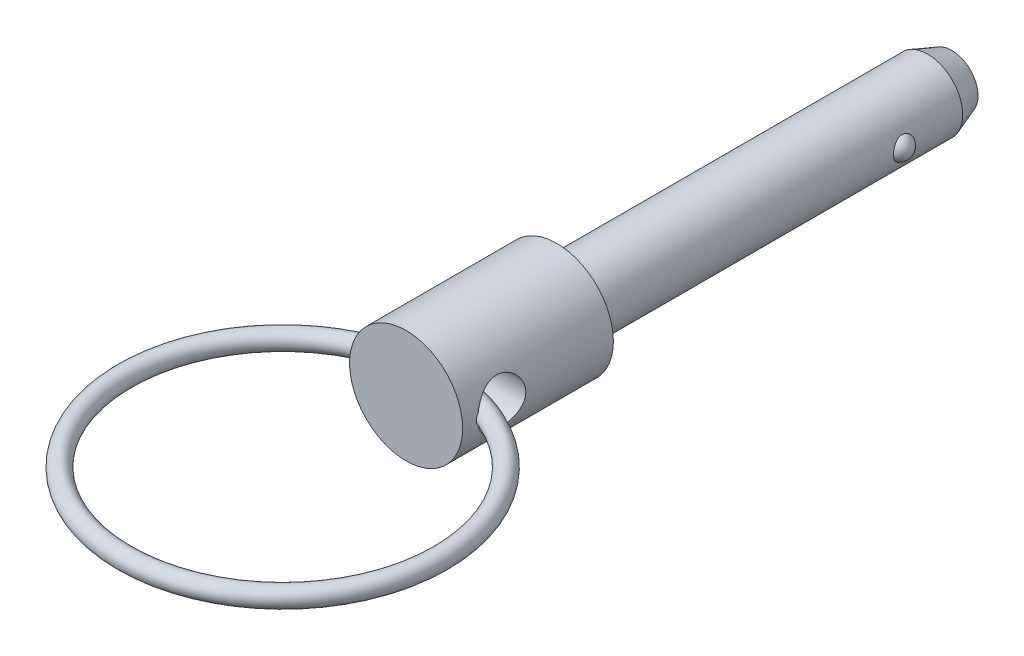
ISO-10303-21;
HEADER;
FILE_DESCRIPTION(('STEP AP214'),'2;1');
FILE_NAME('part.step','',(''),(''),'','','');
FILE_SCHEMA(('AUTOMOTIVE_DESIGN { 1 0 10303 214 1 1 1 1 }'));
ENDSEC;
DATA;
#1=APPLICATION_CONTEXT('core data for automotive mechanical design processes');
#2=APPLICATION_PROTOCOL_DEFINITION('international standard','automotive_design',2000,#1);
#3=PRODUCT_CONTEXT('',#1,'mechanical');
#4=PRODUCT('Part','Part','',(#3));
#5=PRODUCT_RELATED_PRODUCT_CATEGORY('part','',(#4));
#6=PRODUCT_DEFINITION_FORMATION('','',#4);
#7=PRODUCT_DEFINITION_CONTEXT('part definition',#1,'design');
#8=PRODUCT_DEFINITION('design','',#6,#7);
#9=PRODUCT_DEFINITION_SHAPE('','',#8);
#10=(LENGTH_UNIT() NAMED_UNIT(*) SI_UNIT(.MILLI.,.METRE.));
#11=(NAMED_UNIT(*) PLANE_ANGLE_UNIT() SI_UNIT($,.RADIAN.));
#12=(NAMED_UNIT(*) SI_UNIT($,.STERADIAN.) SOLID_ANGLE_UNIT());
#13=UNCERTAINTY_MEASURE_WITH_UNIT(LENGTH_MEASURE(1.E-05),#10,'distance_accuracy_value','');
#14=(GEOMETRIC_REPRESENTATION_CONTEXT(3) GLOBAL_UNCERTAINTY_ASSIGNED_CONTEXT((#13)) GLOBAL_UNIT_ASSIGNED_CONTEXT((#10,
#11,#12)) REPRESENTATION_CONTEXT('',''));
#15=CARTESIAN_POINT('',(0.,0.,0.));
#16=DIRECTION('',(0.,0.,1.));
#17=DIRECTION('',(1.,0.,0.));
#18=AXIS2_PLACEMENT_3D('',#15,#16,#17);
#19=CARTESIAN_POINT('',(6.35,0.,9.398));
#20=DIRECTION('',(-1.,0.,0.));
#21=DIRECTION('',(0.,0.,-1.));
#22=AXIS2_PLACEMENT_3D('',#19,#20,#21);
#23=CYLINDRICAL_SURFACE('',#22,2.0193);
#24=CARTESIAN_POINT('',(-4.76270000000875,0.498153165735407,11.3548893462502));
#25=CARTESIAN_POINT('',(-4.72833190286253,0.475048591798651,11.3607446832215));
#26=CARTESIAN_POINT('',(-4.69505034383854,0.449919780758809,11.3667299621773));
#27=CARTESIAN_POINT('',(-4.63192457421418,0.394832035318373,11.3785339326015));
#28=CARTESIAN_POINT('',(-4.60213511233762,0.36481030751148,11.3843491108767));
#29=CARTESIAN_POINT('',(-4.55535458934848,0.308281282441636,11.3937756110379));
#30=CARTESIAN_POINT('',(-4.53705372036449,0.282907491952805,11.3975656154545));
#31=CARTESIAN_POINT('',(-4.50470768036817,0.229597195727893,11.4043835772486));
#32=CARTESIAN_POINT('',(-4.49064226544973,0.201673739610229,11.4074151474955));
#33=CARTESIAN_POINT('',(-4.46975490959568,0.148629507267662,11.4119668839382));
#34=CARTESIAN_POINT('',(-4.46210314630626,0.123852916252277,11.413657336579));
#35=CARTESIAN_POINT('',(-4.45097170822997,0.0733134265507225,11.4161269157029));
#36=CARTESIAN_POINT('',(-4.4474922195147,0.0475504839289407,11.4169060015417));
#37=CARTESIAN_POINT('',(-4.44500621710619,-0.00425946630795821,11.4174619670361));
#38=CARTESIAN_POINT('',(-4.44600914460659,-0.0303069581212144,11.4172367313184));
#39=CARTESIAN_POINT('',(-4.45241947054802,-0.0818207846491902,11.4158064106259));
#40=CARTESIAN_POINT('',(-4.45782777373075,-0.10728699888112,11.414601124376));
#41=CARTESIAN_POINT('',(-4.47240849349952,-0.156294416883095,11.4113883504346));
#42=CARTESIAN_POINT('',(-4.48147591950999,-0.179868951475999,11.4094032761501));
#43=CARTESIAN_POINT('',(-4.50279050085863,-0.225454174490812,11.404805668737));
#44=CARTESIAN_POINT('',(-4.51503925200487,-0.24746407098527,11.4021928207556));
#45=CARTESIAN_POINT('',(-4.55011891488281,-0.302206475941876,11.394845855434));
#46=CARTESIAN_POINT('',(-4.57493397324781,-0.33362129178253,11.3897686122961));
#47=CARTESIAN_POINT('',(-4.62912866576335,-0.392111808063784,11.3790894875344));
#48=CARTESIAN_POINT('',(-4.65852008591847,-0.419175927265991,11.3734862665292));
#49=CARTESIAN_POINT('',(-4.71307862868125,-0.4633355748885,11.3635175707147));
#50=CARTESIAN_POINT('',(-4.73757440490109,-0.481267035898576,11.3591766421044));
#51=CARTESIAN_POINT('',(-4.76270000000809,-0.49815316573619,11.35488934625));
#52=B_SPLINE_CURVE_WITH_KNOTS('',3,(#24,#25,#26,#27,#28,#29,#30,#31,#32,#33,#34,#35,#36,#37,#38,
#39,#40,#41,#42,#43,#44,#45,#46,#47,#48,#49,#50,#51),.UNSPECIFIED.,.F.,.F.,(4,2,2,2,2,2,2,2,2,2,
2,2,2,4),(0.,0.125801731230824,0.253367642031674,0.347579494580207,0.441333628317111,
0.518959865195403,0.596589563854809,0.674382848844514,0.752192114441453,0.82791171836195,
0.903669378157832,1.02403641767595,1.14471874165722,1.23653238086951),.UNSPECIFIED.);
#53=CARTESIAN_POINT('',(-4.73813099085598,0.481166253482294,11.3591352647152));
#54=VERTEX_POINT('',#53);
#55=CARTESIAN_POINT('',(-4.73813099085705,-0.481166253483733,11.359135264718));
#56=VERTEX_POINT('',#55);
#57=EDGE_CURVE('E40',#54,#56,#52,.T.);
#58=ORIENTED_EDGE('',*,*,#57,.F.);
#59=CARTESIAN_POINT('',(-4.7625,0.,11.4173));
#60=CARTESIAN_POINT('',(-4.76249489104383,-0.108112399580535,11.4172937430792));
#61=CARTESIAN_POINT('',(-4.75878025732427,-0.216312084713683,11.4085747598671));
#62=CARTESIAN_POINT('',(-4.74429807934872,-0.429541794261,11.3740482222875));
#63=CARTESIAN_POINT('',(-4.73352107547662,-0.534567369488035,11.3482177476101));
#64=CARTESIAN_POINT('',(-4.70606638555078,-0.738151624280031,11.280597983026));
#65=CARTESIAN_POINT('',(-4.68940628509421,-0.836728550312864,11.238856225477));
#66=CARTESIAN_POINT('',(-4.65179514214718,-1.02541561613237,11.1408163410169));
#67=CARTESIAN_POINT('',(-4.63084399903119,-1.11552555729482,11.0845178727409));
#68=CARTESIAN_POINT('',(-4.58553515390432,-1.28946876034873,10.9559107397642));
#69=CARTESIAN_POINT('',(-4.56106355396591,-1.37280723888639,10.8829734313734));
#70=CARTESIAN_POINT('',(-4.51195602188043,-1.52649281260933,10.7244940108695));
#71=CARTESIAN_POINT('',(-4.48732001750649,-1.59683374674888,10.638945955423));
#72=CARTESIAN_POINT('',(-4.43925108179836,-1.7261116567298,10.4523438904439));
#73=CARTESIAN_POINT('',(-4.41594507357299,-1.78427664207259,10.3507188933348));
#74=CARTESIAN_POINT('',(-4.37499469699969,-1.88246618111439,10.1379969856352));
#75=CARTESIAN_POINT('',(-4.35734737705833,-1.92250019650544,10.0269050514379));
#76=CARTESIAN_POINT('',(-4.33095312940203,-1.98122376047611,9.80411364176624));
#77=CARTESIAN_POINT('',(-4.32180970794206,-2.0008697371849,9.69271508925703));
#78=CARTESIAN_POINT('',(-4.31232297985,-2.02124136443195,9.46785625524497));
#79=CARTESIAN_POINT('',(-4.31197457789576,-2.02197796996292,9.35439720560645));
#80=CARTESIAN_POINT('',(-4.31978298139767,-2.00522830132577,9.13832342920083));
#81=CARTESIAN_POINT('',(-4.32726229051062,-1.98919366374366,9.03556669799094));
#82=CARTESIAN_POINT('',(-4.34873498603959,-1.94179810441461,8.83436976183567));
#83=CARTESIAN_POINT('',(-4.36272967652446,-1.91043411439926,8.73593042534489));
#84=CARTESIAN_POINT('',(-4.39597564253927,-1.83265370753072,8.54363008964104));
#85=CARTESIAN_POINT('',(-4.41533413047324,-1.7859262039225,8.44991428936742));
#86=CARTESIAN_POINT('',(-4.45710273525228,-1.67896759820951,8.27128429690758));
#87=CARTESIAN_POINT('',(-4.47951396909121,-1.61873154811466,8.1863733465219));
#88=CARTESIAN_POINT('',(-4.52725353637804,-1.48026834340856,8.0199216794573));
#89=CARTESIAN_POINT('',(-4.55266534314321,-1.40092677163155,7.93932933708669));
#90=CARTESIAN_POINT('',(-4.6018976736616,-1.22958667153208,7.79224755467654));
#91=CARTESIAN_POINT('',(-4.62571737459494,-1.13758167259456,7.72576536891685));
#92=CARTESIAN_POINT('',(-4.66982369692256,-0.940529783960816,7.60732387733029));
#93=CARTESIAN_POINT('',(-4.69000583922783,-0.835212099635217,7.55577397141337));
#94=CARTESIAN_POINT('',(-4.72372878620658,-0.616416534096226,7.47153070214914));
#95=CARTESIAN_POINT('',(-4.73728278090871,-0.502955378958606,7.43879986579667));
#96=CARTESIAN_POINT('',(-4.75192155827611,-0.323662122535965,7.40374908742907));
#97=CARTESIAN_POINT('',(-4.75587275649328,-0.259363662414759,7.39437239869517));
#98=CARTESIAN_POINT('',(-4.76116348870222,-0.130053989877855,7.3818460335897));
#99=CARTESIAN_POINT('',(-4.76250307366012,-0.0650427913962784,7.3786962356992));
#100=CARTESIAN_POINT('',(-4.76249489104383,0.108112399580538,7.37870625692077));
#101=CARTESIAN_POINT('',(-4.75878025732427,0.216312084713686,7.38742524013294));
#102=CARTESIAN_POINT('',(-4.74429807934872,0.429541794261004,7.42195177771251));
#103=CARTESIAN_POINT('',(-4.73352107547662,0.53456736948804,7.44778225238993));
#104=CARTESIAN_POINT('',(-4.70606638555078,0.738151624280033,7.51540201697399));
#105=CARTESIAN_POINT('',(-4.68940628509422,0.836728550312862,7.55714377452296));
#106=CARTESIAN_POINT('',(-4.65179514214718,1.02541561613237,7.65518365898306));
#107=CARTESIAN_POINT('',(-4.63084399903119,1.11552555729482,7.71148212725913));
#108=CARTESIAN_POINT('',(-4.58553515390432,1.28946876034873,7.84008926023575));
#109=CARTESIAN_POINT('',(-4.56106355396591,1.37280723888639,7.91302656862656));
#110=CARTESIAN_POINT('',(-4.51195602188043,1.52649281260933,8.0715059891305));
#111=CARTESIAN_POINT('',(-4.48732001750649,1.59683374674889,8.15705404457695));
#112=CARTESIAN_POINT('',(-4.43925108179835,1.7261116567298,8.3436561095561));
#113=CARTESIAN_POINT('',(-4.41594507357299,1.78427664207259,8.44528110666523));
#114=CARTESIAN_POINT('',(-4.37499469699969,1.88246618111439,8.65800301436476));
#115=CARTESIAN_POINT('',(-4.35734737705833,1.92250019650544,8.76909494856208));
#116=CARTESIAN_POINT('',(-4.33095312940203,1.98122376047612,8.99188635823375));
#117=CARTESIAN_POINT('',(-4.32180970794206,2.00086973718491,9.10328491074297));
#118=CARTESIAN_POINT('',(-4.31232297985,2.02124136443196,9.32814374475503));
#119=CARTESIAN_POINT('',(-4.31197457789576,2.02197796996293,9.44160279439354));
#120=CARTESIAN_POINT('',(-4.31978298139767,2.00522830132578,9.65767657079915));
#121=CARTESIAN_POINT('',(-4.32726229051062,1.98919366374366,9.76043330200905));
#122=CARTESIAN_POINT('',(-4.34873498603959,1.94179810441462,9.96163023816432));
#123=CARTESIAN_POINT('',(-4.36272967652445,1.91043411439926,10.0600695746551));
#124=CARTESIAN_POINT('',(-4.39597564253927,1.83265370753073,10.252369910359));
#125=CARTESIAN_POINT('',(-4.41533413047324,1.78592620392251,10.3460857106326));
#126=CARTESIAN_POINT('',(-4.45710273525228,1.67896759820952,10.5247157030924));
#127=CARTESIAN_POINT('',(-4.47951396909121,1.61873154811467,10.6096266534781));
#128=CARTESIAN_POINT('',(-4.52725353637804,1.48026834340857,10.7760783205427));
#129=CARTESIAN_POINT('',(-4.55266534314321,1.40092677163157,10.8566706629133));
#130=CARTESIAN_POINT('',(-4.60189767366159,1.22958667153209,11.0037524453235));
#131=CARTESIAN_POINT('',(-4.62571737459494,1.13758167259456,11.0702346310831));
#132=CARTESIAN_POINT('',(-4.66982369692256,0.940529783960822,11.1886761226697));
#133=CARTESIAN_POINT('',(-4.69000583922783,0.835212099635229,11.2402260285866));
#134=CARTESIAN_POINT('',(-4.72372878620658,0.616416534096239,11.3244692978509));
#135=CARTESIAN_POINT('',(-4.73728278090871,0.502955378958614,11.3572001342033));
#136=CARTESIAN_POINT('',(-4.75192155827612,0.323662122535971,11.3922509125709));
#137=CARTESIAN_POINT('',(-4.75587275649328,0.259363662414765,11.4016276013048));
#138=CARTESIAN_POINT('',(-4.76116348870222,0.130053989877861,11.4141539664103));
#139=CARTESIAN_POINT('',(-4.76250307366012,0.0650427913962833,11.4173037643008));
#140=CARTESIAN_POINT('',(-4.7625,0.,11.4173));
#141=B_SPLINE_CURVE_WITH_KNOTS('',3,(#59,#60,#61,#62,#63,#64,#65,#66,#67,#68,#69,#70,#71,#72,
#73,#74,#75,#76,#77,#78,#79,#80,#81,#82,#83,#84,#85,#86,#87,#88,#89,#90,#91,#92,#93,#94,#95,#96,
#97,#98,#99,#100,#101,#102,#103,#104,#105,#106,#107,#108,#109,#110,#111,#112,#113,#114,#115,
#116,#117,#118,#119,#120,#121,#122,#123,#124,#125,#126,#127,#128,#129,#130,#131,#132,#133,#134,
#135,#136,#137,#138,#139,#140),.UNSPECIFIED.,.T.,.F.,(4,2,2,2,2,2,2,2,2,2,2,2,2,2,2,2,2,2,2,2,2,
2,2,2,2,2,2,2,2,2,2,2,2,2,2,2,2,2,2,2,4),(0.,0.324084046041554,0.648603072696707,
0.97216015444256,1.29572482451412,1.63451297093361,1.97346129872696,2.32983137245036,
2.68601525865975,3.02460962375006,3.36300782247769,3.6743618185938,3.98577815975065,
4.30393445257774,4.6222074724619,4.96838833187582,5.31474674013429,5.66985671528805,
6.02425711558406,6.21923699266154,6.41421306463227,6.73829711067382,7.06281613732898,
7.38637321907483,7.70993788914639,8.04872603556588,8.38767436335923,8.74404443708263,
9.10022832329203,9.43882268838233,9.77722088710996,10.0885748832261,10.3999912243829,
10.71814751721,11.0364205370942,11.3826013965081,11.7289598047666,12.0840697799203,
12.4384701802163,12.6334500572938,12.8284261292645),.UNSPECIFIED.);
#142=EDGE_CURVE('E54',#56,#54,#141,.T.);
#143=ORIENTED_EDGE('',*,*,#142,.F.);
#144=EDGE_LOOP('',(#58,#143));
#145=FACE_BOUND('',#144,.T.);
#146=CARTESIAN_POINT('',(4.76270000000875,-0.498153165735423,11.3548893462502));
#147=CARTESIAN_POINT('',(4.72833190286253,-0.475048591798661,11.3607446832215));
#148=CARTESIAN_POINT('',(4.69505034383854,-0.44991978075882,11.3667299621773));
#149=CARTESIAN_POINT('',(4.63192457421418,-0.394832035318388,11.3785339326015));
#150=CARTESIAN_POINT('',(4.60213511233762,-0.364810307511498,11.3843491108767));
#151=CARTESIAN_POINT('',(4.55535458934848,-0.308281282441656,11.3937756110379));
#152=CARTESIAN_POINT('',(4.53705372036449,-0.282907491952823,11.3975656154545));
#153=CARTESIAN_POINT('',(4.50470768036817,-0.229597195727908,11.4043835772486));
#154=CARTESIAN_POINT('',(4.49064226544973,-0.201673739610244,11.4074151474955));
#155=CARTESIAN_POINT('',(4.46975490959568,-0.148629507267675,11.4119668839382));
#156=CARTESIAN_POINT('',(4.46210314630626,-0.123852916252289,11.413657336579));
#157=CARTESIAN_POINT('',(4.45097170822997,-0.0733134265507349,11.4161269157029));
#158=CARTESIAN_POINT('',(4.4474922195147,-0.0475504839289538,11.4169060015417));
#159=CARTESIAN_POINT('',(4.44500621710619,0.00425946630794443,11.4174619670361));
#160=CARTESIAN_POINT('',(4.44600914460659,0.0303069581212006,11.4172367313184));
#161=CARTESIAN_POINT('',(4.45241947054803,0.0818207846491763,11.4158064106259));
#162=CARTESIAN_POINT('',(4.45782777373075,0.107286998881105,11.414601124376));
#163=CARTESIAN_POINT('',(4.47240849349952,0.15629441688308,11.4113883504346));
#164=CARTESIAN_POINT('',(4.48147591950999,0.179868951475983,11.4094032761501));
#165=CARTESIAN_POINT('',(4.50279050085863,0.225454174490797,11.404805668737));
#166=CARTESIAN_POINT('',(4.51503925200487,0.247464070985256,11.4021928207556));
#167=CARTESIAN_POINT('',(4.55011891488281,0.302206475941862,11.394845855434));
#168=CARTESIAN_POINT('',(4.57493397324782,0.333621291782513,11.3897686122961));
#169=CARTESIAN_POINT('',(4.62912866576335,0.392111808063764,11.3790894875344));
#170=CARTESIAN_POINT('',(4.65852008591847,0.419175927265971,11.3734862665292));
#171=CARTESIAN_POINT('',(4.71307862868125,0.463335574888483,11.3635175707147));
#172=CARTESIAN_POINT('',(4.73757440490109,0.481267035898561,11.3591766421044));
#173=CARTESIAN_POINT('',(4.76270000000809,0.498153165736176,11.35488934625));
#174=B_SPLINE_CURVE_WITH_KNOTS('',3,(#146,#147,#148,#149,#150,#151,#152,#153,#154,#155,#156,
#157,#158,#159,#160,#161,#162,#163,#164,#165,#166,#167,#168,#169,#170,#171,#172,#173),
.UNSPECIFIED.,.F.,.F.,(4,2,2,2,2,2,2,2,2,2,2,2,2,4),(0.,0.125801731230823,0.253367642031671,
0.347579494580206,0.441333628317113,0.518959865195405,0.59658956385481,0.674382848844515,
0.752192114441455,0.827911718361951,0.903669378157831,1.02403641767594,1.14471874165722,
1.23653238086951),.UNSPECIFIED.);
#175=CARTESIAN_POINT('',(4.73813099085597,-0.481166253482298,11.3591352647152));
#176=VERTEX_POINT('',#175);
#177=CARTESIAN_POINT('',(4.73813099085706,0.481166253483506,11.359135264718));
#178=VERTEX_POINT('',#177);
#179=EDGE_CURVE('E33',#176,#178,#174,.T.);
#180=ORIENTED_EDGE('',*,*,#179,.F.);
#181=CARTESIAN_POINT('',(4.7625,0.,7.3787));
#182=CARTESIAN_POINT('',(4.76249489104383,-0.108112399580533,7.37870625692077));
#183=CARTESIAN_POINT('',(4.75878025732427,-0.216312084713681,7.38742524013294));
#184=CARTESIAN_POINT('',(4.74429807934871,-0.429541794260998,7.4219517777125));
#185=CARTESIAN_POINT('',(4.73352107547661,-0.534567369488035,7.44778225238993));
#186=CARTESIAN_POINT('',(4.70606638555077,-0.738151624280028,7.51540201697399));
#187=CARTESIAN_POINT('',(4.68940628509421,-0.836728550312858,7.55714377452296));
#188=CARTESIAN_POINT('',(4.65179514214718,-1.02541561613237,7.65518365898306));
#189=CARTESIAN_POINT('',(4.63084399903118,-1.11552555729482,7.71148212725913));
#190=CARTESIAN_POINT('',(4.58553515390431,-1.28946876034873,7.84008926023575));
#191=CARTESIAN_POINT('',(4.5610635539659,-1.37280723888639,7.91302656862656));
#192=CARTESIAN_POINT('',(4.51195602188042,-1.52649281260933,8.0715059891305));
#193=CARTESIAN_POINT('',(4.48732001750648,-1.59683374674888,8.15705404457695));
#194=CARTESIAN_POINT('',(4.43925108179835,-1.7261116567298,8.3436561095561));
#195=CARTESIAN_POINT('',(4.41594507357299,-1.78427664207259,8.44528110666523));
#196=CARTESIAN_POINT('',(4.37499469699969,-1.88246618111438,8.65800301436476));
#197=CARTESIAN_POINT('',(4.35734737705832,-1.92250019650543,8.76909494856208));
#198=CARTESIAN_POINT('',(4.33095312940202,-1.98122376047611,8.99188635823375));
#199=CARTESIAN_POINT('',(4.32180970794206,-2.0008697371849,9.10328491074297));
#200=CARTESIAN_POINT('',(4.31232297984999,-2.02124136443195,9.32814374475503));
#201=CARTESIAN_POINT('',(4.31197457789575,-2.02197796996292,9.44160279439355));
#202=CARTESIAN_POINT('',(4.31978298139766,-2.00522830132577,9.65767657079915));
#203=CARTESIAN_POINT('',(4.32726229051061,-1.98919366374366,9.76043330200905));
#204=CARTESIAN_POINT('',(4.34873498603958,-1.94179810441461,9.96163023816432));
#205=CARTESIAN_POINT('',(4.36272967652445,-1.91043411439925,10.0600695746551));
#206=CARTESIAN_POINT('',(4.39597564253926,-1.83265370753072,10.252369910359));
#207=CARTESIAN_POINT('',(4.41533413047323,-1.7859262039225,10.3460857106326));
#208=CARTESIAN_POINT('',(4.45710273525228,-1.67896759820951,10.5247157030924));
#209=CARTESIAN_POINT('',(4.4795139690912,-1.61873154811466,10.6096266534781));
#210=CARTESIAN_POINT('',(4.52725353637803,-1.48026834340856,10.7760783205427));
#211=CARTESIAN_POINT('',(4.55266534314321,-1.40092677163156,10.8566706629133));
#212=CARTESIAN_POINT('',(4.60189767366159,-1.22958667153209,11.0037524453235));
#213=CARTESIAN_POINT('',(4.62571737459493,-1.13758167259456,11.0702346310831));
#214=CARTESIAN_POINT('',(4.66982369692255,-0.940529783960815,11.1886761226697));
#215=CARTESIAN_POINT('',(4.69000583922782,-0.835212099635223,11.2402260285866));
#216=CARTESIAN_POINT('',(4.72372878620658,-0.616416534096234,11.3244692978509));
#217=CARTESIAN_POINT('',(4.7372827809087,-0.502955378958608,11.3572001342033));
#218=CARTESIAN_POINT('',(4.75192155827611,-0.323662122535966,11.3922509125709));
#219=CARTESIAN_POINT('',(4.75587275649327,-0.25936366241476,11.4016276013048));
#220=CARTESIAN_POINT('',(4.76116348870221,-0.130053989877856,11.4141539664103));
#221=CARTESIAN_POINT('',(4.76250307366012,-0.0650427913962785,11.4173037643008));
#222=CARTESIAN_POINT('',(4.76249489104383,0.10811239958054,11.4172937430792));
#223=CARTESIAN_POINT('',(4.75878025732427,0.216312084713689,11.4085747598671));
#224=CARTESIAN_POINT('',(4.74429807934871,0.429541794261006,11.3740482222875));
#225=CARTESIAN_POINT('',(4.73352107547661,0.534567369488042,11.3482177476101));
#226=CARTESIAN_POINT('',(4.70606638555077,0.738151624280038,11.280597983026));
#227=CARTESIAN_POINT('',(4.68940628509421,0.83672855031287,11.238856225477));
#228=CARTESIAN_POINT('',(4.65179514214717,1.02541561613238,11.1408163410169));
#229=CARTESIAN_POINT('',(4.63084399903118,1.11552555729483,11.0845178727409));
#230=CARTESIAN_POINT('',(4.58553515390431,1.28946876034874,10.9559107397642));
#231=CARTESIAN_POINT('',(4.5610635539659,1.3728072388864,10.8829734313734));
#232=CARTESIAN_POINT('',(4.51195602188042,1.52649281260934,10.7244940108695));
#233=CARTESIAN_POINT('',(4.48732001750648,1.59683374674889,10.638945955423));
#234=CARTESIAN_POINT('',(4.43925108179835,1.72611165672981,10.4523438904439));
#235=CARTESIAN_POINT('',(4.41594507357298,1.78427664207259,10.3507188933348));
#236=CARTESIAN_POINT('',(4.37499469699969,1.8824661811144,10.1379969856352));
#237=CARTESIAN_POINT('',(4.35734737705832,1.92250019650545,10.0269050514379));
#238=CARTESIAN_POINT('',(4.33095312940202,1.98122376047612,9.80411364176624));
#239=CARTESIAN_POINT('',(4.32180970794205,2.00086973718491,9.69271508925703));
#240=CARTESIAN_POINT('',(4.31232297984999,2.02124136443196,9.46785625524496));
#241=CARTESIAN_POINT('',(4.31197457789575,2.02197796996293,9.35439720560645));
#242=CARTESIAN_POINT('',(4.31978298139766,2.00522830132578,9.13832342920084));
#243=CARTESIAN_POINT('',(4.32726229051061,1.98919366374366,9.03556669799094));
#244=CARTESIAN_POINT('',(4.34873498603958,1.94179810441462,8.83436976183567));
#245=CARTESIAN_POINT('',(4.36272967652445,1.91043411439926,8.73593042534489));
#246=CARTESIAN_POINT('',(4.39597564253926,1.83265370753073,8.54363008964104));
#247=CARTESIAN_POINT('',(4.41533413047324,1.7859262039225,8.44991428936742));
#248=CARTESIAN_POINT('',(4.45710273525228,1.67896759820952,8.27128429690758));
#249=CARTESIAN_POINT('',(4.47951396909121,1.61873154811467,8.1863733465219));
#250=CARTESIAN_POINT('',(4.52725353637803,1.48026834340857,8.0199216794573));
#251=CARTESIAN_POINT('',(4.55266534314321,1.40092677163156,7.93932933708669));
#252=CARTESIAN_POINT('',(4.60189767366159,1.22958667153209,7.79224755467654));
#253=CARTESIAN_POINT('',(4.62571737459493,1.13758167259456,7.72576536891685));
#254=CARTESIAN_POINT('',(4.66982369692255,0.940529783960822,7.60732387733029));
#255=CARTESIAN_POINT('',(4.69000583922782,0.835212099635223,7.55577397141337));
#256=CARTESIAN_POINT('',(4.72372878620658,0.616416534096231,7.47153070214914));
#257=CARTESIAN_POINT('',(4.7372827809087,0.50295537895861,7.43879986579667));
#258=CARTESIAN_POINT('',(4.75192155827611,0.32366212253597,7.40374908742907));
#259=CARTESIAN_POINT('',(4.75587275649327,0.259363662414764,7.39437239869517));
#260=CARTESIAN_POINT('',(4.76116348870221,0.13005398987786,7.3818460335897));
#261=CARTESIAN_POINT('',(4.76250307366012,0.0650427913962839,7.3786962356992));
#262=CARTESIAN_POINT('',(4.7625,0.,7.3787));
#263=B_SPLINE_CURVE_WITH_KNOTS('',3,(#181,#182,#183,#184,#185,#186,#187,#188,#189,#190,#191,
#192,#193,#194,#195,#196,#197,#198,#199,#200,#201,#202,#203,#204,#205,#206,#207,#208,#209,#210,
#211,#212,#213,#214,#215,#216,#217,#218,#219,#220,#221,#222,#223,#224,#225,#226,#227,#228,#229,
#230,#231,#232,#233,#234,#235,#236,#237,#238,#239,#240,#241,#242,#243,#244,#245,#246,#247,#248,
#249,#250,#251,#252,#253,#254,#255,#256,#257,#258,#259,#260,#261,#262),.UNSPECIFIED.,.T.,.F.,(4,
2,2,2,2,2,2,2,2,2,2,2,2,2,2,2,2,2,2,2,2,2,2,2,2,2,2,2,2,2,2,2,2,2,2,2,2,2,2,2,4),(0.,
0.324084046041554,0.648603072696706,0.972160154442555,1.29572482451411,1.63451297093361,
1.97346129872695,2.32983137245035,2.68601525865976,3.02460962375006,3.36300782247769,
3.67436181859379,3.98577815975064,4.30393445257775,4.6222074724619,4.96838833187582,
5.31474674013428,5.66985671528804,6.02425711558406,6.21923699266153,6.41421306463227,
6.73829711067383,7.06281613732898,7.38637321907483,7.70993788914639,8.04872603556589,
8.38767436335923,8.74404443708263,9.10022832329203,9.43882268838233,9.77722088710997,
10.0885748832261,10.3999912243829,10.71814751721,11.0364205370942,11.3826013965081,
11.7289598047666,12.0840697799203,12.4384701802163,12.6334500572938,12.8284261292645),.UNSPECIFIED.);
#264=EDGE_CURVE('E50',#178,#176,#263,.T.);
#265=ORIENTED_EDGE('',*,*,#264,.F.);
#266=EDGE_LOOP('',(#180,#265));
#267=FACE_BOUND('',#266,.T.);
#268=ADVANCED_FACE('F14',(#145,#267),#23,.F.);
#269=CARTESIAN_POINT('',(0.,0.,-23.2664));
#270=DIRECTION('',(0.,0.,-1.));
#271=DIRECTION('',(1.,0.,0.));
#272=AXIS2_PLACEMENT_3D('',#269,#270,#271);
#273=CYLINDRICAL_SURFACE('',#272,4.7625);
#274=ORIENTED_EDGE('',*,*,#264,.T.);
#275=CARTESIAN_POINT('',(4.75672783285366,-0.234410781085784,9.86389096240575));
#276=CARTESIAN_POINT('',(4.75463715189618,-0.276823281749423,9.87695364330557));
#277=CARTESIAN_POINT('',(4.75202741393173,-0.318142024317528,9.89358560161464));
#278=CARTESIAN_POINT('',(4.74605906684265,-0.397384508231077,9.93354154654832));
#279=CARTESIAN_POINT('',(4.74269965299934,-0.435304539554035,9.95687273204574));
#280=CARTESIAN_POINT('',(4.7356117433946,-0.506628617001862,10.0095466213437));
#281=CARTESIAN_POINT('',(4.731883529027,-0.540036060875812,10.0388847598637));
#282=CARTESIAN_POINT('',(4.72446904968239,-0.60146335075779,10.1027270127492));
#283=CARTESIAN_POINT('',(4.72078277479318,-0.629484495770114,10.1372298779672));
#284=CARTESIAN_POINT('',(4.71381973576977,-0.679675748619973,10.2106969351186));
#285=CARTESIAN_POINT('',(4.71054647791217,-0.701797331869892,10.2496945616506));
#286=CARTESIAN_POINT('',(4.70478201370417,-0.739457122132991,10.3307970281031));
#287=CARTESIAN_POINT('',(4.7022909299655,-0.75499429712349,10.3729023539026));
#288=CARTESIAN_POINT('',(4.69825743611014,-0.779709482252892,10.4605198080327));
#289=CARTESIAN_POINT('',(4.69674995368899,-0.788654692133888,10.5060989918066));
#290=CARTESIAN_POINT('',(4.694941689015,-0.799348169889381,10.5981124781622));
#291=CARTESIAN_POINT('',(4.69464124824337,-0.801094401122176,10.6445470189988));
#292=CARTESIAN_POINT('',(4.69525593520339,-0.797484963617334,10.7400273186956));
#293=CARTESIAN_POINT('',(4.6962479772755,-0.791679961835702,10.7890554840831));
#294=CARTESIAN_POINT('',(4.69943436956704,-0.772538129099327,10.88558205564));
#295=CARTESIAN_POINT('',(4.70162918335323,-0.759198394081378,10.9330798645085));
#296=CARTESIAN_POINT('',(4.7071366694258,-0.724294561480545,11.0283694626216));
#297=CARTESIAN_POINT('',(4.71051187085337,-0.702258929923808,11.0759856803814));
#298=CARTESIAN_POINT('',(4.71792781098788,-0.650571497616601,11.1668661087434));
#299=CARTESIAN_POINT('',(4.72196879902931,-0.620916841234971,11.2101286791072));
#300=CARTESIAN_POINT('',(4.73024120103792,-0.554392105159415,11.2909794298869));
#301=CARTESIAN_POINT('',(4.73447324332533,-0.517496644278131,11.3285468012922));
#302=CARTESIAN_POINT('',(4.74255290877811,-0.437280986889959,11.3961281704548));
#303=CARTESIAN_POINT('',(4.74640083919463,-0.393965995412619,11.4261482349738));
#304=CARTESIAN_POINT('',(4.75279848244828,-0.306647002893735,11.4743172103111));
#305=CARTESIAN_POINT('',(4.7554392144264,-0.263139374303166,11.4933494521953));
#306=CARTESIAN_POINT('',(4.75956072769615,-0.173210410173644,11.5225838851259));
#307=CARTESIAN_POINT('',(4.76104300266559,-0.126792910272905,11.5327974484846));
#308=CARTESIAN_POINT('',(4.76251214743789,-0.0392228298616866,11.5429046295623));
#309=CARTESIAN_POINT('',(4.76267454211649,0.00179015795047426,11.5440098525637));
#310=CARTESIAN_POINT('',(4.76194485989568,0.0833582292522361,11.5390051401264));
#311=CARTESIAN_POINT('',(4.76105302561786,0.123913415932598,11.5328968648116));
#312=CARTESIAN_POINT('',(4.75839052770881,0.201390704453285,11.5143023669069));
#313=CARTESIAN_POINT('',(4.75666474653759,0.238393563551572,11.5021410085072));
#314=CARTESIAN_POINT('',(4.75253498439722,0.310009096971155,11.4722173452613));
#315=CARTESIAN_POINT('',(4.75013086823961,0.344621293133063,11.4544539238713));
#316=CARTESIAN_POINT('',(4.74468244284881,0.413106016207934,11.4126354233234));
#317=CARTESIAN_POINT('',(4.74160529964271,0.446760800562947,11.3882294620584));
#318=CARTESIAN_POINT('',(4.73521429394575,0.510064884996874,11.3347169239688));
#319=CARTESIAN_POINT('',(4.73190032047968,0.539712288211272,11.3056081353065));
#320=CARTESIAN_POINT('',(4.72489226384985,0.59814174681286,11.2395451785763));
#321=CARTESIAN_POINT('',(4.72120374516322,0.626328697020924,11.2020637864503));
#322=CARTESIAN_POINT('',(4.71424234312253,0.676737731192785,11.1232450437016));
#323=CARTESIAN_POINT('',(4.71096968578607,0.69895657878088,11.0819056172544));
#324=CARTESIAN_POINT('',(4.70485086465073,0.739081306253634,10.9918449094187));
#325=CARTESIAN_POINT('',(4.70208579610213,0.756287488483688,10.9428045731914));
#326=CARTESIAN_POINT('',(4.69779376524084,0.782507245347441,10.8425158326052));
#327=CARTESIAN_POINT('',(4.69626707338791,0.79151903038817,10.7912669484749));
#328=CARTESIAN_POINT('',(4.69466144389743,0.800990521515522,10.6869325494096));
#329=CARTESIAN_POINT('',(4.69461132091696,0.801280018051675,10.6338307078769));
#330=CARTESIAN_POINT('',(4.69610058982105,0.7925062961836,10.5284214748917));
#331=CARTESIAN_POINT('',(4.69763938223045,0.78344660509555,10.4761137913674));
#332=CARTESIAN_POINT('',(4.70202301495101,0.756674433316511,10.3770218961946));
#333=CARTESIAN_POINT('',(4.70478816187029,0.739486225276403,10.3300928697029));
#334=CARTESIAN_POINT('',(4.71127399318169,0.696967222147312,10.2401511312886));
#335=CARTESIAN_POINT('',(4.71499427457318,0.671639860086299,10.1971367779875));
#336=CARTESIAN_POINT('',(4.72264431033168,0.615452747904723,10.1192841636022));
#337=CARTESIAN_POINT('',(4.72654308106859,0.585080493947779,10.0840903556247));
#338=CARTESIAN_POINT('',(4.73429341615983,0.518639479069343,10.0195645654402));
#339=CARTESIAN_POINT('',(4.73814499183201,0.482572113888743,9.99023115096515));
#340=CARTESIAN_POINT('',(4.74520575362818,0.407195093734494,9.93927752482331));
#341=CARTESIAN_POINT('',(4.74843306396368,0.368048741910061,9.91741780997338));
#342=CARTESIAN_POINT('',(4.75404590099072,0.286564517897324,9.88060848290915));
#343=CARTESIAN_POINT('',(4.75643129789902,0.244226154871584,9.86565993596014));
#344=CARTESIAN_POINT('',(4.76007108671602,0.158026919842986,9.84320151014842));
#345=CARTESIAN_POINT('',(4.76133640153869,0.114185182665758,9.83561971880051));
#346=CARTESIAN_POINT('',(4.76263391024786,0.025866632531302,9.82784590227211));
#347=CARTESIAN_POINT('',(4.76266746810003,-0.0186094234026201,9.82764570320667));
#348=CARTESIAN_POINT('',(4.76170334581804,-0.091872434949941,9.83342133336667));
#349=CARTESIAN_POINT('',(4.76105293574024,-0.120844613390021,9.83731729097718));
#350=CARTESIAN_POINT('',(4.75925240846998,-0.178172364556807,9.84825826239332));
#351=CARTESIAN_POINT('',(4.7581022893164,-0.206527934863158,9.85530328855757));
#352=CARTESIAN_POINT('',(4.75672783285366,-0.234410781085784,9.86389096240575));
#353=B_SPLINE_CURVE_WITH_KNOTS('',3,(#275,#276,#277,#278,#279,#280,#281,#282,#283,#284,#285,
#286,#287,#288,#289,#290,#291,#292,#293,#294,#295,#296,#297,#298,#299,#300,#301,#302,#303,#304,
#305,#306,#307,#308,#309,#310,#311,#312,#313,#314,#315,#316,#317,#318,#319,#320,#321,#322,#323,
#324,#325,#326,#327,#328,#329,#330,#331,#332,#333,#334,#335,#336,#337,#338,#339,#340,#341,#342,
#343,#344,#345,#346,#347,#348,#349,#350,#351,#352),.UNSPECIFIED.,.T.,.F.,(4,2,2,2,2,2,2,2,2,2,2,
2,2,2,2,2,2,2,2,2,2,2,2,2,2,2,2,2,2,2,2,2,2,2,2,2,2,2,4),(0.,0.133176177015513,
0.266496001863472,0.399714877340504,0.532901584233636,0.667152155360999,0.801423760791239,
0.940235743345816,1.07908699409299,1.22659070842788,1.37415131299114,1.53115159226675,
1.68821080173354,1.84583071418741,2.00332351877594,2.14516294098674,2.28681917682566,
2.4092664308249,2.53168551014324,2.64814679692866,2.76463131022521,2.88919364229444,
3.01381473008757,3.15436663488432,3.29499460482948,3.45041783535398,3.60587500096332,
3.76436388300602,3.92279299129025,4.07216500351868,4.22147409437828,4.36072714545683,
4.49994612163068,4.63415709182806,4.76838874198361,4.90129648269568,5.03405704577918,
5.12160944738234,5.20916219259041),.UNSPECIFIED.);
#354=EDGE_CURVE('E27',#176,#178,#353,.T.);
#355=ORIENTED_EDGE('',*,*,#354,.T.);
#356=EDGE_LOOP('',(#274,#355));
#357=FACE_BOUND('',#356,.T.);
#358=CARTESIAN_POINT('',(0.,0.,1.13520304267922E-11));
#359=DIRECTION('',(0.,0.,-1.));
#360=DIRECTION('',(1.,0.,0.));
#361=AXIS2_PLACEMENT_3D('',#358,#359,#360);
#362=CIRCLE('',#361,4.76249999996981);
#363=CARTESIAN_POINT('',(4.76249999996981,0.,1.1351820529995E-11));
#364=VERTEX_POINT('',#363);
#365=EDGE_CURVE('E59',#364,#364,#362,.T.);
#366=ORIENTED_EDGE('',*,*,#365,.F.);
#367=EDGE_LOOP('',(#366));
#368=FACE_BOUND('',#367,.T.);
#369=CARTESIAN_POINT('',(0.,0.,12.7000000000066));
#370=DIRECTION('',(0.,0.,-1.));
#371=DIRECTION('',(1.,0.,0.));
#372=AXIS2_PLACEMENT_3D('',#369,#370,#371);
#373=CIRCLE('',#372,4.76249999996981);
#374=CARTESIAN_POINT('',(4.76249999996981,0.,12.7000000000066));
#375=VERTEX_POINT('',#374);
#376=EDGE_CURVE('E135',#375,#375,#373,.T.);
#377=ORIENTED_EDGE('',*,*,#376,.T.);
#378=EDGE_LOOP('',(#377));
#379=FACE_BOUND('',#378,.T.);
#380=ORIENTED_EDGE('',*,*,#142,.T.);
#381=CARTESIAN_POINT('',(-4.75672783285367,-0.234410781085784,9.86389096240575));
#382=CARTESIAN_POINT('',(-4.75880797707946,-0.192184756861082,9.85088943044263));
#383=CARTESIAN_POINT('',(-4.76037619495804,-0.148820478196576,9.84140883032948));
#384=CARTESIAN_POINT('',(-4.76231114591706,-0.0610623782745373,9.8297605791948));
#385=CARTESIAN_POINT('',(-4.76267662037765,-0.0166675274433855,9.82760058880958));
#386=CARTESIAN_POINT('',(-4.76216356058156,0.0718447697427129,9.83066350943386));
#387=CARTESIAN_POINT('',(-4.76128553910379,0.115962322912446,9.83588337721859));
#388=CARTESIAN_POINT('',(-4.75838343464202,0.202671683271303,9.85356395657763));
#389=CARTESIAN_POINT('',(-4.75635960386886,0.245263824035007,9.86602307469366));
#390=CARTESIAN_POINT('',(-4.75138989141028,0.327732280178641,9.89785096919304));
#391=CARTESIAN_POINT('',(-4.74844388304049,0.36760822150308,9.91722069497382));
#392=CARTESIAN_POINT('',(-4.74195662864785,0.443516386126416,9.96233891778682));
#393=CARTESIAN_POINT('',(-4.73841538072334,0.479548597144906,9.98808743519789));
#394=CARTESIAN_POINT('',(-4.73111995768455,0.546865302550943,10.0453065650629));
#395=CARTESIAN_POINT('',(-4.72736528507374,0.578138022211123,10.0767909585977));
#396=CARTESIAN_POINT('',(-4.72006096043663,0.635024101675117,10.1445276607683));
#397=CARTESIAN_POINT('',(-4.71651131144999,0.660637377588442,10.1807800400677));
#398=CARTESIAN_POINT('',(-4.70994476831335,0.705946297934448,10.2575433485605));
#399=CARTESIAN_POINT('',(-4.70693606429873,0.725553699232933,10.298106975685));
#400=CARTESIAN_POINT('',(-4.70181675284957,0.758021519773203,10.3818966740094));
#401=CARTESIAN_POINT('',(-4.69970628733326,0.770880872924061,10.4251231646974));
#402=CARTESIAN_POINT('',(-4.69650867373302,0.790134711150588,10.5148288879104));
#403=CARTESIAN_POINT('',(-4.69546563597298,0.796251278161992,10.5613691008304));
#404=CARTESIAN_POINT('',(-4.69462220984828,0.801207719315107,10.6548424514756));
#405=CARTESIAN_POINT('',(-4.69482220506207,0.800045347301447,10.7017757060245));
#406=CARTESIAN_POINT('',(-4.69645733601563,0.790392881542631,10.7979976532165));
#407=CARTESIAN_POINT('',(-4.69797327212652,0.78142331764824,10.8472368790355));
#408=CARTESIAN_POINT('',(-4.70214662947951,0.755902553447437,10.943667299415));
#409=CARTESIAN_POINT('',(-4.70480451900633,0.739348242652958,10.9908576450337));
#410=CARTESIAN_POINT('',(-4.71113533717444,0.697907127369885,11.0846488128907));
#411=CARTESIAN_POINT('',(-4.71485784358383,0.672595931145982,11.1310597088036));
#412=CARTESIAN_POINT('',(-4.72278864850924,0.61443697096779,11.2188860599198));
#413=CARTESIAN_POINT('',(-4.72699707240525,0.581587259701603,11.2603002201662));
#414=CARTESIAN_POINT('',(-4.73530162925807,0.509526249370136,11.3359421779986));
#415=CARTESIAN_POINT('',(-4.73939847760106,0.47042640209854,11.3702753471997));
#416=CARTESIAN_POINT('',(-4.74699023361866,0.386343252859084,11.4308675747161));
#417=CARTESIAN_POINT('',(-4.75048579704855,0.341366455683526,11.457135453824));
#418=CARTESIAN_POINT('',(-4.7559922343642,0.25237648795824,11.4974010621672));
#419=CARTESIAN_POINT('',(-4.75812829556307,0.208856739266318,11.5124686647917));
#420=CARTESIAN_POINT('',(-4.76120337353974,0.119700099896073,11.5339491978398));
#421=CARTESIAN_POINT('',(-4.76214369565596,0.0740655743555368,11.540371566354));
#422=CARTESIAN_POINT('',(-4.76265411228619,-0.0117455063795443,11.54386707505));
#423=CARTESIAN_POINT('',(-4.76238280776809,-0.0518805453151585,11.5420222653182));
#424=CARTESIAN_POINT('',(-4.76085712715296,-0.131220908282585,11.531508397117));
#425=CARTESIAN_POINT('',(-4.75960284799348,-0.170426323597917,11.5228400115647));
#426=CARTESIAN_POINT('',(-4.75629335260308,-0.245921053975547,11.499439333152));
#427=CARTESIAN_POINT('',(-4.75425749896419,-0.282257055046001,11.4848531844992));
#428=CARTESIAN_POINT('',(-4.74958711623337,-0.352221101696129,11.4503009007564));
#429=CARTESIAN_POINT('',(-4.74695243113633,-0.385848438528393,11.4303333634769));
#430=CARTESIAN_POINT('',(-4.74107206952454,-0.452616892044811,11.3838151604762));
#431=CARTESIAN_POINT('',(-4.73779315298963,-0.485460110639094,11.3568423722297));
#432=CARTESIAN_POINT('',(-4.73110830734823,-0.546785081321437,11.2983457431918));
#433=CARTESIAN_POINT('',(-4.72770231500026,-0.575264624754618,11.2668196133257));
#434=CARTESIAN_POINT('',(-4.72061927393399,-0.630909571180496,11.1957249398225));
#435=CARTESIAN_POINT('',(-4.71696449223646,-0.657423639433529,11.1556436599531));
#436=CARTESIAN_POINT('',(-4.7102323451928,-0.704040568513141,11.071860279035));
#437=CARTESIAN_POINT('',(-4.70715528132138,-0.724140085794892,11.0281563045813));
#438=CARTESIAN_POINT('',(-4.70165375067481,-0.759079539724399,10.9340419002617));
#439=CARTESIAN_POINT('',(-4.69931471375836,-0.773270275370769,10.8833836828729));
#440=CARTESIAN_POINT('',(-4.69601325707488,-0.793074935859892,10.7803615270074));
#441=CARTESIAN_POINT('',(-4.69505096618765,-0.798688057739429,10.7279974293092));
#442=CARTESIAN_POINT('',(-4.69467378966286,-0.800903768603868,10.6230225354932));
#443=CARTESIAN_POINT('',(-4.69525980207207,-0.79750112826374,10.5704116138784));
#444=CARTESIAN_POINT('',(-4.69796643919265,-0.78139905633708,10.4666696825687));
#445=CARTESIAN_POINT('',(-4.70008633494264,-0.768704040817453,10.4155379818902));
#446=CARTESIAN_POINT('',(-4.70543825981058,-0.735202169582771,10.3197920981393));
#447=CARTESIAN_POINT('',(-4.70858907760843,-0.714975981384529,10.2749703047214));
#448=CARTESIAN_POINT('',(-4.71564813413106,-0.666826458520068,10.189721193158));
#449=CARTESIAN_POINT('',(-4.71955625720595,-0.638904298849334,10.1492932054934));
#450=CARTESIAN_POINT('',(-4.72737726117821,-0.578090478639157,10.0766022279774));
#451=CARTESIAN_POINT('',(-4.73127475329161,-0.545615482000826,10.0439879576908));
#452=CARTESIAN_POINT('',(-4.73883375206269,-0.475496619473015,9.98491901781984));
#453=CARTESIAN_POINT('',(-4.74249555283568,-0.437859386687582,9.95845655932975));
#454=CARTESIAN_POINT('',(-4.74798881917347,-0.372400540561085,9.92049627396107));
#455=CARTESIAN_POINT('',(-4.75001326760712,-0.345732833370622,9.90699794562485));
#456=CARTESIAN_POINT('',(-4.7536791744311,-0.291020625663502,9.88309301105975));
#457=CARTESIAN_POINT('',(-4.75532064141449,-0.262976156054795,9.87268633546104));
#458=CARTESIAN_POINT('',(-4.75672783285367,-0.234410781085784,9.86389096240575));
#459=B_SPLINE_CURVE_WITH_KNOTS('',3,(#381,#382,#383,#384,#385,#386,#387,#388,#389,#390,#391,
#392,#393,#394,#395,#396,#397,#398,#399,#400,#401,#402,#403,#404,#405,#406,#407,#408,#409,#410,
#411,#412,#413,#414,#415,#416,#417,#418,#419,#420,#421,#422,#423,#424,#425,#426,#427,#428,#429,
#430,#431,#432,#433,#434,#435,#436,#437,#438,#439,#440,#441,#442,#443,#444,#445,#446,#447,#448,
#449,#450,#451,#452,#453,#454,#455,#456,#457,#458),.UNSPECIFIED.,.T.,.F.,(4,2,2,2,2,2,2,2,2,2,2,
2,2,2,2,2,2,2,2,2,2,2,2,2,2,2,2,2,2,2,2,2,2,2,2,2,2,2,4),(0.,0.132584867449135,
0.265308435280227,0.397977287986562,0.53061694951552,0.663274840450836,0.795933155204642,
0.928914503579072,1.06189782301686,1.19675044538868,1.33162436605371,1.47187070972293,
1.6121603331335,1.76172674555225,1.91135454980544,2.06958609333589,2.22785855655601,
2.38357184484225,2.53911422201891,2.67661376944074,2.81396308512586,2.93389956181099,
3.05382421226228,3.17095185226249,3.28811004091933,3.41548078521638,3.54291578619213,
3.68690552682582,3.83097019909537,3.98821148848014,4.14546749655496,4.30281473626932,
4.46008724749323,4.60714088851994,4.75417209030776,4.89206605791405,5.02978447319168,
5.11947848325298,5.20917048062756),.UNSPECIFIED.);
#460=EDGE_CURVE('E9',#54,#56,#459,.T.);
#461=ORIENTED_EDGE('',*,*,#460,.T.);
#462=EDGE_LOOP('',(#380,#461));
#463=FACE_BOUND('',#462,.T.);
#464=ADVANCED_FACE('F52',(#357,#368,#379,#463),#273,.T.);
#465=CARTESIAN_POINT('',(0.,0.,-10.));
#466=DIRECTION('',(0.,0.,1.));
#467=DIRECTION('',(-0.810321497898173,-0.585985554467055,0.));
#468=AXIS2_PLACEMENT_3D('',#465,#466,#467);
#469=CYLINDRICAL_SURFACE('',#468,2.95529);
#470=CARTESIAN_POINT('',(0.,0.,0.));
#471=DIRECTION('',(0.,0.,-1.));
#472=DIRECTION('',(0.810321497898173,0.585985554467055,0.));
#473=AXIS2_PLACEMENT_3D('',#470,#471,#472);
#474=CIRCLE('',#473,2.95529);
#475=CARTESIAN_POINT('',(2.39473501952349,1.73175724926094,0.));
#476=VERTEX_POINT('',#475);
#477=EDGE_CURVE('E48',#476,#476,#474,.T.);
#478=ORIENTED_EDGE('',*,*,#477,.T.);
#479=EDGE_LOOP('',(#478));
#480=FACE_BOUND('',#479,.T.);
#481=CARTESIAN_POINT('',(-2.95529,0.,-27.1918269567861));
#482=CARTESIAN_POINT('',(-2.95528983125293,0.0550926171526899,-27.1918267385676));
#483=CARTESIAN_POINT('',(-2.95373607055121,0.110186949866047,-27.1874652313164));
#484=CARTESIAN_POINT('',(-2.94767937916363,0.218829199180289,-27.170085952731));
#485=CARTESIAN_POINT('',(-2.94317634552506,0.272377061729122,-27.1570678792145));
#486=CARTESIAN_POINT('',(-2.93168588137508,0.376429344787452,-27.1225739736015));
#487=CARTESIAN_POINT('',(-2.92469717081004,0.426932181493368,-27.1010937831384));
#488=CARTESIAN_POINT('',(-2.90898593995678,0.523382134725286,-27.0500375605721));
#489=CARTESIAN_POINT('',(-2.900263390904,0.569329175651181,-27.0204613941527));
#490=CARTESIAN_POINT('',(-2.88219034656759,0.654674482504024,-26.9542064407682));
#491=CARTESIAN_POINT('',(-2.87284943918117,0.694149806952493,-26.9176245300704));
#492=CARTESIAN_POINT('',(-2.8545494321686,0.765938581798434,-26.8379086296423));
#493=CARTESIAN_POINT('',(-2.84559022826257,0.798253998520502,-26.7947764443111));
#494=CARTESIAN_POINT('',(-2.82961358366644,0.853114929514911,-26.7053619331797));
#495=CARTESIAN_POINT('',(-2.82252187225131,0.876065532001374,-26.6593419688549));
#496=CARTESIAN_POINT('',(-2.81062752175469,0.913510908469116,-26.5637072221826));
#497=CARTESIAN_POINT('',(-2.80582362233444,0.928010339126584,-26.5140944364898));
#498=CARTESIAN_POINT('',(-2.79938954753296,0.947234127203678,-26.4165034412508));
#499=CARTESIAN_POINT('',(-2.79755758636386,0.952581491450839,-26.3686607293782));
#500=CARTESIAN_POINT('',(-2.79664698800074,0.955252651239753,-26.2727309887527));
#501=CARTESIAN_POINT('',(-2.79756762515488,0.952578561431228,-26.2246440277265));
#502=CARTESIAN_POINT('',(-2.80195740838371,0.93958306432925,-26.1316029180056));
#503=CARTESIAN_POINT('',(-2.8053237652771,0.929569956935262,-26.086600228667));
#504=CARTESIAN_POINT('',(-2.81411497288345,0.90260476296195,-25.9989431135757));
#505=CARTESIAN_POINT('',(-2.81953996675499,0.885652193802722,-25.9562888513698));
#506=CARTESIAN_POINT('',(-2.83202715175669,0.844881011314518,-25.8733947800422));
#507=CARTESIAN_POINT('',(-2.83912488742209,0.820910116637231,-25.8332354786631));
#508=CARTESIAN_POINT('',(-2.85415971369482,0.767002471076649,-25.7573259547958));
#509=CARTESIAN_POINT('',(-2.8620970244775,0.737064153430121,-25.7215768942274));
#510=CARTESIAN_POINT('',(-2.87857646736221,0.669928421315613,-25.6530007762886));
#511=CARTESIAN_POINT('',(-2.8871245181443,0.632386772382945,-25.6205121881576));
#512=CARTESIAN_POINT('',(-2.90347009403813,0.552505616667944,-25.5618624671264));
#513=CARTESIAN_POINT('',(-2.91126739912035,0.510164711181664,-25.5357031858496));
#514=CARTESIAN_POINT('',(-2.92581141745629,0.419068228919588,-25.4887292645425));
#515=CARTESIAN_POINT('',(-2.93246494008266,0.370078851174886,-25.4683383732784));
#516=CARTESIAN_POINT('',(-2.94343457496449,0.269265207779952,-25.4354688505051));
#517=CARTESIAN_POINT('',(-2.94775026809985,0.217440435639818,-25.4229916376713));
#518=CARTESIAN_POINT('',(-2.95371459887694,0.11069201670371,-25.4058753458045));
#519=CARTESIAN_POINT('',(-2.95527581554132,0.0557221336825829,-25.4014929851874));
#520=CARTESIAN_POINT('',(-2.95530399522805,-0.0542264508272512,-25.4014136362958));
#521=CARTESIAN_POINT('',(-2.95377072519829,-0.109205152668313,-25.4057173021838));
#522=CARTESIAN_POINT('',(-2.9477431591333,-0.218040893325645,-25.4230090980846));
#523=CARTESIAN_POINT('',(-2.94322672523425,-0.271886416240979,-25.4360621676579));
#524=CARTESIAN_POINT('',(-2.93168430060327,-0.376477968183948,-25.4707094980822));
#525=CARTESIAN_POINT('',(-2.92465821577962,-0.427223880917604,-25.4923040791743));
#526=CARTESIAN_POINT('',(-2.90890921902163,-0.523800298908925,-25.5435004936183));
#527=CARTESIAN_POINT('',(-2.90019735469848,-0.569659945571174,-25.5730506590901));
#528=CARTESIAN_POINT('',(-2.88203224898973,-0.655401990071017,-25.6396632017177));
#529=CARTESIAN_POINT('',(-2.87257908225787,-0.695284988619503,-25.6767248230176));
#530=CARTESIAN_POINT('',(-2.85437009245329,-0.76656665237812,-25.7562615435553));
#531=CARTESIAN_POINT('',(-2.84560167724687,-0.798193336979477,-25.7985289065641));
#532=CARTESIAN_POINT('',(-2.82953382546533,-0.853409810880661,-25.8882771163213));
#533=CARTESIAN_POINT('',(-2.82223368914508,-0.877003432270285,-25.9357554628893));
#534=CARTESIAN_POINT('',(-2.81047926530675,-0.913946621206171,-26.0312649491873));
#535=CARTESIAN_POINT('',(-2.80587004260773,-0.927865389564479,-26.0790567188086));
#536=CARTESIAN_POINT('',(-2.79937177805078,-0.9472932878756,-26.1764945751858));
#537=CARTESIAN_POINT('',(-2.79748150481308,-0.952806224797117,-26.2261398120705));
#538=CARTESIAN_POINT('',(-2.79669000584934,-0.95512492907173,-26.3225397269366));
#539=CARTESIAN_POINT('',(-2.79760942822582,-0.952453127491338,-26.369281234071));
#540=CARTESIAN_POINT('',(-2.80194263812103,-0.939628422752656,-26.4616015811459));
#541=CARTESIAN_POINT('',(-2.80535623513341,-0.929476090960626,-26.5071805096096));
#542=CARTESIAN_POINT('',(-2.81425442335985,-0.902171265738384,-26.5955474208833));
#543=CARTESIAN_POINT('',(-2.81972167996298,-0.885077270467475,-26.6383553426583));
#544=CARTESIAN_POINT('',(-2.83215289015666,-0.84445150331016,-26.7205558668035));
#545=CARTESIAN_POINT('',(-2.83911711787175,-0.820918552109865,-26.7599478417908));
#546=CARTESIAN_POINT('',(-2.85422317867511,-0.766794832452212,-26.8363336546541));
#547=CARTESIAN_POINT('',(-2.86240622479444,-0.735912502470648,-26.8731124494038));
#548=CARTESIAN_POINT('',(-2.87884865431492,-0.668704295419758,-26.9412804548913));
#549=CARTESIAN_POINT('',(-2.88710805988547,-0.632376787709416,-26.9726680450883));
#550=CARTESIAN_POINT('',(-2.90347190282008,-0.552590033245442,-27.0314661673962));
#551=CARTESIAN_POINT('',(-2.91152747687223,-0.50881357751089,-27.0584602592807));
#552=CARTESIAN_POINT('',(-2.92604240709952,-0.417325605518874,-27.1052503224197));
#553=CARTESIAN_POINT('',(-2.93250136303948,-0.36961310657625,-27.1250444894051));
#554=CARTESIAN_POINT('',(-2.94346621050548,-0.269109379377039,-27.1579124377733));
#555=CARTESIAN_POINT('',(-2.94786226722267,-0.216184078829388,-27.1706139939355));
#556=CARTESIAN_POINT('',(-2.95377440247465,-0.108839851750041,-27.1875718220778));
#557=CARTESIAN_POINT('',(-2.9552901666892,-0.0544207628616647,-27.1918271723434));
#558=CARTESIAN_POINT('',(-2.95529,0.,-27.1918269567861));
#559=B_SPLINE_CURVE_WITH_KNOTS('',3,(#481,#482,#483,#484,#485,#486,#487,#488,#489,#490,#491,
#492,#493,#494,#495,#496,#497,#498,#499,#500,#501,#502,#503,#504,#505,#506,#507,#508,#509,#510,
#511,#512,#513,#514,#515,#516,#517,#518,#519,#520,#521,#522,#523,#524,#525,#526,#527,#528,#529,
#530,#531,#532,#533,#534,#535,#536,#537,#538,#539,#540,#541,#542,#543,#544,#545,#546,#547,#548,
#549,#550,#551,#552,#553,#554,#555,#556,#557,#558),.UNSPECIFIED.,.T.,.F.,(4,2,2,2,2,2,2,2,2,2,2,
2,2,2,2,2,2,2,2,2,2,2,2,2,2,2,2,2,2,2,2,2,2,2,2,2,2,2,4),(0.,0.165087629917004,
0.330181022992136,0.495359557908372,0.660540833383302,0.823584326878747,0.986582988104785,
1.14149686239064,1.2963252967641,1.44011939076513,1.58387558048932,1.72191574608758,
1.85996551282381,2.00126607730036,2.14260378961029,2.2930816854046,2.44360355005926,
2.60331407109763,2.76305321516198,2.92777664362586,3.09251247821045,3.25848475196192,
3.4244632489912,3.58938876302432,3.75429768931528,3.91400268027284,4.07363137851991,
4.22281693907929,4.37193491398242,4.51173733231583,4.65152907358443,4.79016644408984,
4.92882922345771,5.07435173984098,5.21991792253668,5.3753978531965,5.53091671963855,
5.69397331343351,5.85704770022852),.UNSPECIFIED.);
#560=CARTESIAN_POINT('',(-2.95529,0.,-27.1918269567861));
#561=VERTEX_POINT('',#560);
#562=EDGE_CURVE('E127',#561,#561,#559,.T.);
#563=ORIENTED_EDGE('',*,*,#562,.T.);
#564=EDGE_LOOP('',(#563));
#565=FACE_BOUND('',#564,.T.);
#566=CARTESIAN_POINT('',(0.,0.,-31.2344));
#567=DIRECTION('',(0.,0.,-1.));
#568=DIRECTION('',(1.,0.,0.));
#569=AXIS2_PLACEMENT_3D('',#566,#567,#568);
#570=CIRCLE('',#569,2.95529);
#571=CARTESIAN_POINT('',(2.95529,0.,-31.2344));
#572=VERTEX_POINT('',#571);
#573=EDGE_CURVE('E132',#572,#572,#570,.F.);
#574=ORIENTED_EDGE('',*,*,#573,.T.);
#575=EDGE_LOOP('',(#574));
#576=FACE_BOUND('',#575,.T.);
#577=CARTESIAN_POINT('',(2.95529,0.,-27.1918269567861));
#578=CARTESIAN_POINT('',(2.95528983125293,-0.0550926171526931,-27.1918267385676));
#579=CARTESIAN_POINT('',(2.95373607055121,-0.11018694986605,-27.1874652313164));
#580=CARTESIAN_POINT('',(2.94767937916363,-0.218829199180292,-27.170085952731));
#581=CARTESIAN_POINT('',(2.94317634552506,-0.272377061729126,-27.1570678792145));
#582=CARTESIAN_POINT('',(2.93168588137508,-0.376429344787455,-27.1225739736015));
#583=CARTESIAN_POINT('',(2.92469717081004,-0.42693218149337,-27.1010937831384));
#584=CARTESIAN_POINT('',(2.90898593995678,-0.523382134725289,-27.0500375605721));
#585=CARTESIAN_POINT('',(2.900263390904,-0.569329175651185,-27.0204613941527));
#586=CARTESIAN_POINT('',(2.88219034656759,-0.654674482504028,-26.9542064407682));
#587=CARTESIAN_POINT('',(2.87284943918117,-0.694149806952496,-26.9176245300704));
#588=CARTESIAN_POINT('',(2.85454943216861,-0.765938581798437,-26.8379086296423));
#589=CARTESIAN_POINT('',(2.84559022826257,-0.798253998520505,-26.7947764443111));
#590=CARTESIAN_POINT('',(2.82961358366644,-0.853114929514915,-26.7053619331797));
#591=CARTESIAN_POINT('',(2.82252187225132,-0.876065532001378,-26.6593419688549));
#592=CARTESIAN_POINT('',(2.81062752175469,-0.913510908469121,-26.5637072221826));
#593=CARTESIAN_POINT('',(2.80582362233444,-0.928010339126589,-26.5140944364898));
#594=CARTESIAN_POINT('',(2.79938954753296,-0.947234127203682,-26.4165034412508));
#595=CARTESIAN_POINT('',(2.79755758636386,-0.952581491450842,-26.3686607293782));
#596=CARTESIAN_POINT('',(2.79664698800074,-0.955252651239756,-26.2727309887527));
#597=CARTESIAN_POINT('',(2.79756762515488,-0.952578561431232,-26.2246440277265));
#598=CARTESIAN_POINT('',(2.80195740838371,-0.939583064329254,-26.1316029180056));
#599=CARTESIAN_POINT('',(2.8053237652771,-0.929569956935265,-26.086600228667));
#600=CARTESIAN_POINT('',(2.81411497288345,-0.902604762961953,-25.9989431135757));
#601=CARTESIAN_POINT('',(2.81953996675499,-0.885652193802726,-25.9562888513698));
#602=CARTESIAN_POINT('',(2.83202715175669,-0.844881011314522,-25.8733947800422));
#603=CARTESIAN_POINT('',(2.83912488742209,-0.820910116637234,-25.8332354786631));
#604=CARTESIAN_POINT('',(2.85415971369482,-0.767002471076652,-25.7573259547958));
#605=CARTESIAN_POINT('',(2.8620970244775,-0.737064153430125,-25.7215768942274));
#606=CARTESIAN_POINT('',(2.87857646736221,-0.669928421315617,-25.6530007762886));
#607=CARTESIAN_POINT('',(2.8871245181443,-0.632386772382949,-25.6205121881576));
#608=CARTESIAN_POINT('',(2.90347009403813,-0.552505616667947,-25.5618624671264));
#609=CARTESIAN_POINT('',(2.91126739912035,-0.510164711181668,-25.5357031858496));
#610=CARTESIAN_POINT('',(2.92581141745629,-0.419068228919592,-25.4887292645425));
#611=CARTESIAN_POINT('',(2.93246494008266,-0.37007885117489,-25.4683383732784));
#612=CARTESIAN_POINT('',(2.94343457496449,-0.269265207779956,-25.4354688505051));
#613=CARTESIAN_POINT('',(2.94775026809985,-0.217440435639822,-25.4229916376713));
#614=CARTESIAN_POINT('',(2.95371459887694,-0.110692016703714,-25.4058753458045));
#615=CARTESIAN_POINT('',(2.95527581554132,-0.0557221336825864,-25.4014929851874));
#616=CARTESIAN_POINT('',(2.95530399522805,0.0542264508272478,-25.4014136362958));
#617=CARTESIAN_POINT('',(2.95377072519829,0.109205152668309,-25.4057173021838));
#618=CARTESIAN_POINT('',(2.9477431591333,0.218040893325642,-25.4230090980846));
#619=CARTESIAN_POINT('',(2.94322672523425,0.271886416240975,-25.4360621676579));
#620=CARTESIAN_POINT('',(2.93168430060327,0.376477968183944,-25.4707094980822));
#621=CARTESIAN_POINT('',(2.92465821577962,0.4272238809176,-25.4923040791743));
#622=CARTESIAN_POINT('',(2.90890921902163,0.523800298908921,-25.5435004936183));
#623=CARTESIAN_POINT('',(2.90019735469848,0.569659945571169,-25.5730506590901));
#624=CARTESIAN_POINT('',(2.88203224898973,0.655401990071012,-25.6396632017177));
#625=CARTESIAN_POINT('',(2.87257908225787,0.695284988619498,-25.6767248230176));
#626=CARTESIAN_POINT('',(2.85437009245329,0.766566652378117,-25.7562615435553));
#627=CARTESIAN_POINT('',(2.84560167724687,0.798193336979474,-25.7985289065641));
#628=CARTESIAN_POINT('',(2.82953382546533,0.853409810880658,-25.8882771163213));
#629=CARTESIAN_POINT('',(2.82223368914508,0.877003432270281,-25.9357554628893));
#630=CARTESIAN_POINT('',(2.81047926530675,0.913946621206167,-26.0312649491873));
#631=CARTESIAN_POINT('',(2.80587004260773,0.927865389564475,-26.0790567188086));
#632=CARTESIAN_POINT('',(2.79937177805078,0.947293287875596,-26.1764945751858));
#633=CARTESIAN_POINT('',(2.79748150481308,0.952806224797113,-26.2261398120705));
#634=CARTESIAN_POINT('',(2.79669000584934,0.955124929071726,-26.3225397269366));
#635=CARTESIAN_POINT('',(2.79760942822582,0.952453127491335,-26.369281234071));
#636=CARTESIAN_POINT('',(2.80194263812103,0.939628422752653,-26.4616015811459));
#637=CARTESIAN_POINT('',(2.80535623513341,0.929476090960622,-26.5071805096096));
#638=CARTESIAN_POINT('',(2.81425442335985,0.90217126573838,-26.5955474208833));
#639=CARTESIAN_POINT('',(2.81972167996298,0.885077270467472,-26.6383553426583));
#640=CARTESIAN_POINT('',(2.83215289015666,0.844451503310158,-26.7205558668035));
#641=CARTESIAN_POINT('',(2.83911711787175,0.820918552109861,-26.7599478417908));
#642=CARTESIAN_POINT('',(2.85422317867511,0.766794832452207,-26.8363336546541));
#643=CARTESIAN_POINT('',(2.86240622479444,0.735912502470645,-26.8731124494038));
#644=CARTESIAN_POINT('',(2.87884865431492,0.668704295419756,-26.9412804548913));
#645=CARTESIAN_POINT('',(2.88710805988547,0.632376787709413,-26.9726680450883));
#646=CARTESIAN_POINT('',(2.90347190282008,0.552590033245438,-27.0314661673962));
#647=CARTESIAN_POINT('',(2.91152747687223,0.508813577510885,-27.0584602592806));
#648=CARTESIAN_POINT('',(2.92604240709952,0.41732560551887,-27.1052503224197));
#649=CARTESIAN_POINT('',(2.93250136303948,0.369613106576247,-27.1250444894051));
#650=CARTESIAN_POINT('',(2.94346621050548,0.269109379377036,-27.1579124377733));
#651=CARTESIAN_POINT('',(2.94786226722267,0.216184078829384,-27.1706139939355));
#652=CARTESIAN_POINT('',(2.95377440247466,0.108839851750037,-27.1875718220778));
#653=CARTESIAN_POINT('',(2.9552901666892,0.0544207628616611,-27.1918271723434));
#654=CARTESIAN_POINT('',(2.95529,0.,-27.1918269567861));
#655=B_SPLINE_CURVE_WITH_KNOTS('',3,(#577,#578,#579,#580,#581,#582,#583,#584,#585,#586,#587,
#588,#589,#590,#591,#592,#593,#594,#595,#596,#597,#598,#599,#600,#601,#602,#603,#604,#605,#606,
#607,#608,#609,#610,#611,#612,#613,#614,#615,#616,#617,#618,#619,#620,#621,#622,#623,#624,#625,
#626,#627,#628,#629,#630,#631,#632,#633,#634,#635,#636,#637,#638,#639,#640,#641,#642,#643,#644,
#645,#646,#647,#648,#649,#650,#651,#652,#653,#654),.UNSPECIFIED.,.T.,.F.,(4,2,2,2,2,2,2,2,2,2,2,
2,2,2,2,2,2,2,2,2,2,2,2,2,2,2,2,2,2,2,2,2,2,2,2,2,2,2,4),(0.,0.165087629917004,
0.330181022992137,0.495359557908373,0.660540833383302,0.823584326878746,0.986582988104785,
1.14149686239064,1.2963252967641,1.44011939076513,1.58387558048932,1.72191574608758,
1.85996551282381,2.00126607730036,2.14260378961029,2.29308168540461,2.44360355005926,
2.60331407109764,2.76305321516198,2.92777664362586,3.09251247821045,3.25848475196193,
3.4244632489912,3.58938876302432,3.75429768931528,3.91400268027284,4.07363137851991,
4.22281693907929,4.37193491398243,4.51173733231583,4.65152907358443,4.79016644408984,
4.92882922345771,5.07435173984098,5.21991792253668,5.3753978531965,5.53091671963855,
5.69397331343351,5.85704770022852),.UNSPECIFIED.);
#656=CARTESIAN_POINT('',(2.95529,0.,-27.1918269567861));
#657=VERTEX_POINT('',#656);
#658=EDGE_CURVE('E103',#657,#657,#655,.T.);
#659=ORIENTED_EDGE('',*,*,#658,.T.);
#660=EDGE_LOOP('',(#659));
#661=FACE_BOUND('',#660,.T.);
#662=ADVANCED_FACE('F16',(#480,#565,#576,#661),#469,.T.);
#663=CARTESIAN_POINT('',(0.,-4.5085,12.7));
#664=DIRECTION('',(0.,0.,1.));
#665=DIRECTION('',(-1.,0.,0.));
#666=AXIS2_PLACEMENT_3D('',#663,#664,#665);
#667=PLANE('',#666);
#668=ORIENTED_EDGE('',*,*,#376,.F.);
#669=EDGE_LOOP('',(#668));
#670=FACE_BOUND('',#669,.T.);
#671=ADVANCED_FACE('F121',(#670),#667,.T.);
#672=CARTESIAN_POINT('',(0.,-2.95529,0.));
#673=DIRECTION('',(0.,0.,-1.));
#674=DIRECTION('',(1.,0.,0.));
#675=AXIS2_PLACEMENT_3D('',#672,#673,#674);
#676=PLANE('',#675);
#677=ORIENTED_EDGE('',*,*,#365,.T.);
#678=EDGE_LOOP('',(#677));
#679=FACE_BOUND('',#678,.T.);
#680=ORIENTED_EDGE('',*,*,#477,.F.);
#681=EDGE_LOOP('',(#680));
#682=FACE_BOUND('',#681,.T.);
#683=ADVANCED_FACE('F74',(#679,#682),#676,.T.);
#684=CARTESIAN_POINT('',(0.,0.,-33.2664));
#685=DIRECTION('',(0.,0.,-1.));
#686=DIRECTION('',(1.,0.,0.));
#687=AXIS2_PLACEMENT_3D('',#684,#685,#686);
#688=PLANE('',#687);
#689=CARTESIAN_POINT('',(0.,0.,-33.2663999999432));
#690=DIRECTION('',(0.,0.,1.));
#691=DIRECTION('',(-1.,0.,0.));
#692=AXIS2_PLACEMENT_3D('',#689,#690,#691);
#693=CIRCLE('',#692,2.21570248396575);
#694=CARTESIAN_POINT('',(-2.21570248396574,0.,-33.2663999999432));
#695=VERTEX_POINT('',#694);
#696=EDGE_CURVE('E100',#695,#695,#693,.T.);
#697=ORIENTED_EDGE('',*,*,#696,.F.);
#698=EDGE_LOOP('',(#697));
#699=FACE_BOUND('',#698,.T.);
#700=ADVANCED_FACE('F113',(#699),#688,.T.);
#701=CARTESIAN_POINT('',(2.53111,0.,-26.29664));
#702=DIRECTION('',(0.,0.,1.));
#703=DIRECTION('',(1.,0.,0.));
#704=AXIS2_PLACEMENT_3D('',#701,#702,#703);
#705=SPHERICAL_SURFACE('',#704,0.9906);
#706=ORIENTED_EDGE('',*,*,#658,.F.);
#707=EDGE_LOOP('',(#706));
#708=FACE_BOUND('',#707,.T.);
#709=ADVANCED_FACE('F108',(#708),#705,.T.);
#710=CARTESIAN_POINT('',(0.,0.,-31.2344000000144));
#711=DIRECTION('',(0.,0.,1.));
#712=DIRECTION('',(-1.,0.,0.));
#713=AXIS2_PLACEMENT_3D('',#710,#711,#712);
#714=CONICAL_SURFACE('',#713,2.95528999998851,0.349065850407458);
#715=ORIENTED_EDGE('',*,*,#573,.F.);
#716=EDGE_LOOP('',(#715));
#717=FACE_BOUND('',#716,.T.);
#718=ORIENTED_EDGE('',*,*,#696,.T.);
#719=EDGE_LOOP('',(#718));
#720=FACE_BOUND('',#719,.T.);
#721=ADVANCED_FACE('F112',(#717,#720),#714,.T.);
#722=CARTESIAN_POINT('',(-2.53111,0.,-26.29664));
#723=DIRECTION('',(0.,0.,1.));
#724=DIRECTION('',(-1.,0.,0.));
#725=AXIS2_PLACEMENT_3D('',#722,#723,#724);
#726=SPHERICAL_SURFACE('',#725,0.9906);
#727=ORIENTED_EDGE('',*,*,#562,.F.);
#728=EDGE_LOOP('',(#727));
#729=FACE_BOUND('',#728,.T.);
#730=ADVANCED_FACE('F84',(#729),#726,.T.);
#731=CARTESIAN_POINT('',(0.,0.,23.1000000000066));
#732=DIRECTION('',(0.,1.,0.));
#733=DIRECTION('',(0.,0.,1.));
#734=AXIS2_PLACEMENT_3D('',#731,#732,#733);
#735=TOROIDAL_SURFACE('',#734,13.3,0.8);
#736=ORIENTED_EDGE('',*,*,#354,.F.);
#737=ORIENTED_EDGE('',*,*,#179,.T.);
#738=EDGE_LOOP('',(#736,#737));
#739=FACE_BOUND('',#738,.T.);
#740=ORIENTED_EDGE('',*,*,#460,.F.);
#741=ORIENTED_EDGE('',*,*,#57,.T.);
#742=EDGE_LOOP('',(#740,#741));
#743=FACE_BOUND('',#742,.T.);
#744=ADVANCED_FACE('F44',(#739,#743),#735,.T.);
#745=CLOSED_SHELL('',(#268,#464,#662,#671,#683,#700,#709,#721,#730,#744));
#746=MANIFOLD_SOLID_BREP('B1',#745);
#747=ADVANCED_BREP_SHAPE_REPRESENTATION('',(#18,#746),#14);
#748=SHAPE_DEFINITION_REPRESENTATION(#9,#747);
ENDSEC;
END-ISO-10303-21;
